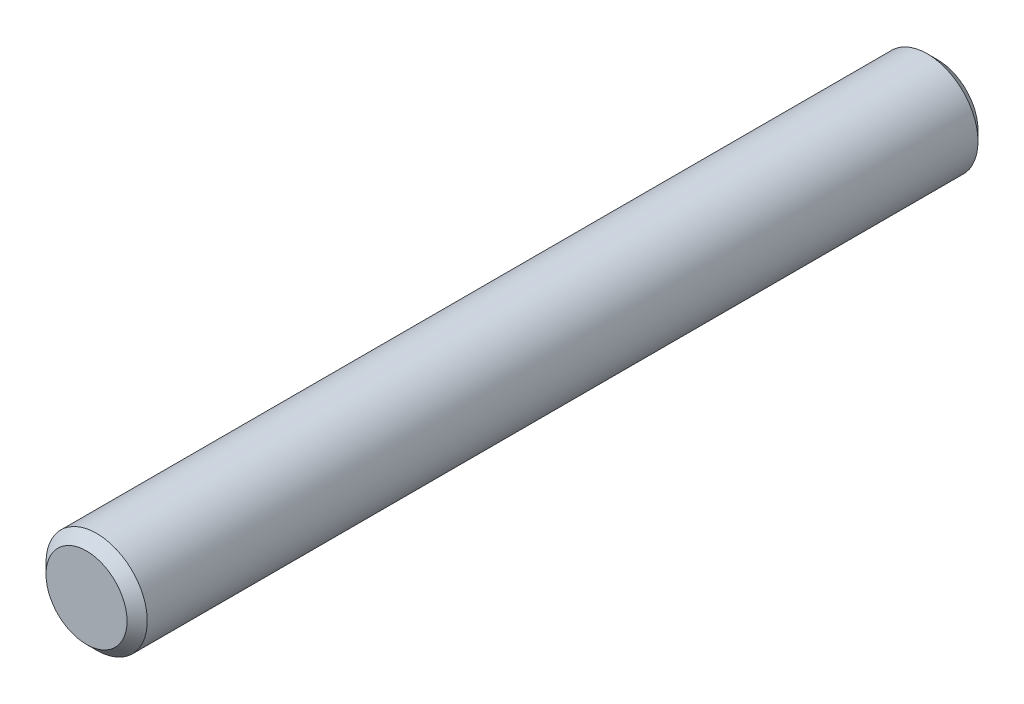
ISO-10303-21;
HEADER;
FILE_DESCRIPTION(('STEP AP214'),'2;1');
FILE_NAME('part.step','',(''),(''),'','','');
FILE_SCHEMA(('AUTOMOTIVE_DESIGN { 1 0 10303 214 1 1 1 1 }'));
ENDSEC;
DATA;
#1=APPLICATION_CONTEXT('core data for automotive mechanical design processes');
#2=APPLICATION_PROTOCOL_DEFINITION('international standard','automotive_design',2000,#1);
#3=PRODUCT_CONTEXT('',#1,'mechanical');
#4=PRODUCT('Part','Part','',(#3));
#5=PRODUCT_RELATED_PRODUCT_CATEGORY('part','',(#4));
#6=PRODUCT_DEFINITION_FORMATION('','',#4);
#7=PRODUCT_DEFINITION_CONTEXT('part definition',#1,'design');
#8=PRODUCT_DEFINITION('design','',#6,#7);
#9=PRODUCT_DEFINITION_SHAPE('','',#8);
#10=(LENGTH_UNIT() NAMED_UNIT(*) SI_UNIT(.MILLI.,.METRE.));
#11=(NAMED_UNIT(*) PLANE_ANGLE_UNIT() SI_UNIT($,.RADIAN.));
#12=(NAMED_UNIT(*) SI_UNIT($,.STERADIAN.) SOLID_ANGLE_UNIT());
#13=UNCERTAINTY_MEASURE_WITH_UNIT(LENGTH_MEASURE(1.E-05),#10,'distance_accuracy_value','');
#14=(GEOMETRIC_REPRESENTATION_CONTEXT(3) GLOBAL_UNCERTAINTY_ASSIGNED_CONTEXT((#13)) GLOBAL_UNIT_ASSIGNED_CONTEXT((#10,
#11,#12)) REPRESENTATION_CONTEXT('',''));
#15=CARTESIAN_POINT('',(0.,0.,0.));
#16=DIRECTION('',(0.,0.,1.));
#17=DIRECTION('',(1.,0.,0.));
#18=AXIS2_PLACEMENT_3D('',#15,#16,#17);
#19=CARTESIAN_POINT('',(0.,0.,21.));
#20=DIRECTION('',(0.,0.,-1.));
#21=DIRECTION('',(-1.,0.,0.));
#22=AXIS2_PLACEMENT_3D('',#19,#20,#21);
#23=CYLINDRICAL_SURFACE('',#22,1.25);
#24=CARTESIAN_POINT('',(0.,0.,20.75));
#25=DIRECTION('',(0.,0.,1.));
#26=DIRECTION('',(1.,0.,0.));
#27=AXIS2_PLACEMENT_3D('',#24,#25,#26);
#28=CIRCLE('',#27,1.25);
#29=CARTESIAN_POINT('',(-1.25,0.,20.75));
#30=VERTEX_POINT('',#29);
#31=EDGE_CURVE('E36',#30,#30,#28,.F.);
#32=CARTESIAN_POINT('',(0.,0.,0.250000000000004));
#33=DIRECTION('',(0.,0.,1.));
#34=DIRECTION('',(1.,0.,0.));
#35=AXIS2_PLACEMENT_3D('',#32,#33,#34);
#36=CIRCLE('',#35,1.25);
#37=CARTESIAN_POINT('',(-1.25,0.,0.25));
#38=VERTEX_POINT('',#37);
#39=EDGE_CURVE('E40',#38,#38,#36,.T.);
#40=CARTESIAN_POINT('',(-1.25,0.,20.75));
#41=CARTESIAN_POINT('',(-1.25,0.,20.5364583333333));
#42=CARTESIAN_POINT('',(-1.25,0.,20.3229166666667));
#43=CARTESIAN_POINT('',(-1.25,0.,19.8958333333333));
#44=CARTESIAN_POINT('',(-1.25,0.,19.6822916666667));
#45=CARTESIAN_POINT('',(-1.25,0.,19.2552083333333));
#46=CARTESIAN_POINT('',(-1.25,0.,19.0416666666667));
#47=CARTESIAN_POINT('',(-1.25,0.,18.6145833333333));
#48=CARTESIAN_POINT('',(-1.25,0.,18.4010416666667));
#49=CARTESIAN_POINT('',(-1.25,0.,17.9739583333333));
#50=CARTESIAN_POINT('',(-1.25,0.,17.7604166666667));
#51=CARTESIAN_POINT('',(-1.25,0.,17.3333333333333));
#52=CARTESIAN_POINT('',(-1.25,0.,17.1197916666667));
#53=CARTESIAN_POINT('',(-1.25,0.,16.6927083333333));
#54=CARTESIAN_POINT('',(-1.25,0.,16.4791666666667));
#55=CARTESIAN_POINT('',(-1.25,0.,16.0520833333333));
#56=CARTESIAN_POINT('',(-1.25,0.,15.8385416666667));
#57=CARTESIAN_POINT('',(-1.25,0.,15.4114583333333));
#58=CARTESIAN_POINT('',(-1.25,0.,15.1979166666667));
#59=CARTESIAN_POINT('',(-1.25,0.,14.7708333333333));
#60=CARTESIAN_POINT('',(-1.25,0.,14.5572916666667));
#61=CARTESIAN_POINT('',(-1.25,0.,14.1302083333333));
#62=CARTESIAN_POINT('',(-1.25,0.,13.9166666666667));
#63=CARTESIAN_POINT('',(-1.25,0.,13.4895833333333));
#64=CARTESIAN_POINT('',(-1.25,0.,13.2760416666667));
#65=CARTESIAN_POINT('',(-1.25,0.,12.8489583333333));
#66=CARTESIAN_POINT('',(-1.25,0.,12.6354166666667));
#67=CARTESIAN_POINT('',(-1.25,0.,12.2083333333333));
#68=CARTESIAN_POINT('',(-1.25,0.,11.9947916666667));
#69=CARTESIAN_POINT('',(-1.25,0.,11.5677083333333));
#70=CARTESIAN_POINT('',(-1.25,0.,11.3541666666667));
#71=CARTESIAN_POINT('',(-1.25,0.,10.9270833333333));
#72=CARTESIAN_POINT('',(-1.25,0.,10.7135416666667));
#73=CARTESIAN_POINT('',(-1.25,0.,10.2864583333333));
#74=CARTESIAN_POINT('',(-1.25,0.,10.0729166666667));
#75=CARTESIAN_POINT('',(-1.25,0.,9.64583333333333));
#76=CARTESIAN_POINT('',(-1.25,0.,9.43229166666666));
#77=CARTESIAN_POINT('',(-1.25,0.,9.00520833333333));
#78=CARTESIAN_POINT('',(-1.25,0.,8.79166666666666));
#79=CARTESIAN_POINT('',(-1.25,0.,8.36458333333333));
#80=CARTESIAN_POINT('',(-1.25,0.,8.15104166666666));
#81=CARTESIAN_POINT('',(-1.25,0.,7.72395833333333));
#82=CARTESIAN_POINT('',(-1.25,0.,7.51041666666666));
#83=CARTESIAN_POINT('',(-1.25,0.,7.08333333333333));
#84=CARTESIAN_POINT('',(-1.25,0.,6.86979166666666));
#85=CARTESIAN_POINT('',(-1.25,0.,6.44270833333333));
#86=CARTESIAN_POINT('',(-1.25,0.,6.22916666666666));
#87=CARTESIAN_POINT('',(-1.25,0.,5.80208333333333));
#88=CARTESIAN_POINT('',(-1.25,0.,5.58854166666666));
#89=CARTESIAN_POINT('',(-1.25,0.,5.16145833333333));
#90=CARTESIAN_POINT('',(-1.25,0.,4.94791666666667));
#91=CARTESIAN_POINT('',(-1.25,0.,4.52083333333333));
#92=CARTESIAN_POINT('',(-1.25,0.,4.30729166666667));
#93=CARTESIAN_POINT('',(-1.25,0.,3.88020833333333));
#94=CARTESIAN_POINT('',(-1.25,0.,3.66666666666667));
#95=CARTESIAN_POINT('',(-1.25,0.,3.23958333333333));
#96=CARTESIAN_POINT('',(-1.25,0.,3.02604166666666));
#97=CARTESIAN_POINT('',(-1.25,0.,2.59895833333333));
#98=CARTESIAN_POINT('',(-1.25,0.,2.38541666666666));
#99=CARTESIAN_POINT('',(-1.25,0.,1.95833333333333));
#100=CARTESIAN_POINT('',(-1.25,0.,1.74479166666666));
#101=CARTESIAN_POINT('',(-1.25,0.,1.31770833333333));
#102=CARTESIAN_POINT('',(-1.25,0.,1.10416666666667));
#103=CARTESIAN_POINT('',(-1.25,0.,0.677083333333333));
#104=CARTESIAN_POINT('',(-1.25,0.,0.463541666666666));
#105=CARTESIAN_POINT('',(-1.25,0.,0.25));
#106=B_SPLINE_CURVE_WITH_KNOTS('',3,(#40,#41,#42,#43,#44,#45,#46,#47,#48,#49,#50,#51,#52,#53,
#54,#55,#56,#57,#58,#59,#60,#61,#62,#63,#64,#65,#66,#67,#68,#69,#70,#71,#72,#73,#74,#75,#76,#77,
#78,#79,#80,#81,#82,#83,#84,#85,#86,#87,#88,#89,#90,#91,#92,#93,#94,#95,#96,#97,#98,#99,#100,
#101,#102,#103,#104,#105),.UNSPECIFIED.,.F.,.F.,(4,2,2,2,2,2,2,2,2,2,2,2,2,2,2,2,2,2,2,2,2,2,2,
2,2,2,2,2,2,2,2,2,4),(0.,0.640625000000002,1.28125,1.921875,2.5625,3.203125,3.84375,4.484375,
5.125,5.765625,6.40625,7.046875,7.6875,8.328125,8.96875,9.609375,10.25,10.890625,11.53125,
12.171875,12.8125,13.453125,14.09375,14.734375,15.375,16.015625,16.65625,17.296875,17.9375,
18.578125,19.21875,19.859375,20.5),.UNSPECIFIED.);
#107=EDGE_CURVE('BSEAM30',#30,#38,#106,.T.);
#108=ORIENTED_EDGE('',*,*,#31,.T.);
#109=ORIENTED_EDGE('',*,*,#39,.T.);
#110=ORIENTED_EDGE('',*,*,#107,.T.);
#111=ORIENTED_EDGE('',*,*,#107,.F.);
#112=EDGE_LOOP('',(#108,#110,#109,#111));
#113=FACE_BOUND('',#112,.T.);
#114=ADVANCED_FACE('F30',(#113),#23,.T.);
#115=CARTESIAN_POINT('',(0.,0.,21.));
#116=DIRECTION('',(0.,0.,1.));
#117=DIRECTION('',(1.,0.,0.));
#118=AXIS2_PLACEMENT_3D('',#115,#116,#117);
#119=PLANE('',#118);
#120=CARTESIAN_POINT('',(0.,0.,21.));
#121=DIRECTION('',(0.,0.,1.));
#122=DIRECTION('',(1.,0.,0.));
#123=AXIS2_PLACEMENT_3D('',#120,#121,#122);
#124=CIRCLE('',#123,0.999999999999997);
#125=CARTESIAN_POINT('',(0.999999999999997,0.,21.));
#126=VERTEX_POINT('',#125);
#127=EDGE_CURVE('E44',#126,#126,#124,.T.);
#128=ORIENTED_EDGE('',*,*,#127,.T.);
#129=EDGE_LOOP('',(#128));
#130=FACE_BOUND('',#129,.T.);
#131=ADVANCED_FACE('F50',(#130),#119,.T.);
#132=CARTESIAN_POINT('',(0.,0.,0.));
#133=DIRECTION('',(0.,0.,1.));
#134=DIRECTION('',(1.,0.,0.));
#135=AXIS2_PLACEMENT_3D('',#132,#133,#134);
#136=PLANE('',#135);
#137=CARTESIAN_POINT('',(0.,0.,0.));
#138=DIRECTION('',(0.,0.,1.));
#139=DIRECTION('',(1.,0.,0.));
#140=AXIS2_PLACEMENT_3D('',#137,#138,#139);
#141=CIRCLE('',#140,0.999999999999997);
#142=CARTESIAN_POINT('',(0.999999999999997,0.,0.));
#143=VERTEX_POINT('',#142);
#144=EDGE_CURVE('E10',#143,#143,#141,.F.);
#145=ORIENTED_EDGE('',*,*,#144,.T.);
#146=EDGE_LOOP('',(#145));
#147=FACE_BOUND('',#146,.T.);
#148=ADVANCED_FACE('F55',(#147),#136,.F.);
#149=CARTESIAN_POINT('',(0.,0.,21.));
#150=DIRECTION('',(0.,0.,-1.));
#151=DIRECTION('',(-1.,0.,0.));
#152=AXIS2_PLACEMENT_3D('',#149,#150,#151);
#153=CONICAL_SURFACE('',#152,0.999999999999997,0.78539816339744);
#154=ORIENTED_EDGE('',*,*,#31,.F.);
#155=EDGE_LOOP('',(#154));
#156=FACE_BOUND('',#155,.T.);
#157=ORIENTED_EDGE('',*,*,#127,.F.);
#158=EDGE_LOOP('',(#157));
#159=FACE_BOUND('',#158,.T.);
#160=ADVANCED_FACE('F52',(#156,#159),#153,.T.);
#161=CARTESIAN_POINT('',(0.,0.,0.250000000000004));
#162=DIRECTION('',(0.,0.,1.));
#163=DIRECTION('',(1.,0.,0.));
#164=AXIS2_PLACEMENT_3D('',#161,#162,#163);
#165=CONICAL_SURFACE('',#164,1.25,0.785398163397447);
#166=ORIENTED_EDGE('',*,*,#144,.F.);
#167=EDGE_LOOP('',(#166));
#168=FACE_BOUND('',#167,.T.);
#169=ORIENTED_EDGE('',*,*,#39,.F.);
#170=EDGE_LOOP('',(#169));
#171=FACE_BOUND('',#170,.T.);
#172=ADVANCED_FACE('F54',(#168,#171),#165,.T.);
#173=CLOSED_SHELL('',(#114,#131,#148,#160,#172));
#174=MANIFOLD_SOLID_BREP('B2',#173);
#175=ADVANCED_BREP_SHAPE_REPRESENTATION('',(#18,#174),#14);
#176=SHAPE_DEFINITION_REPRESENTATION(#9,#175);
ENDSEC;
END-ISO-10303-21;
